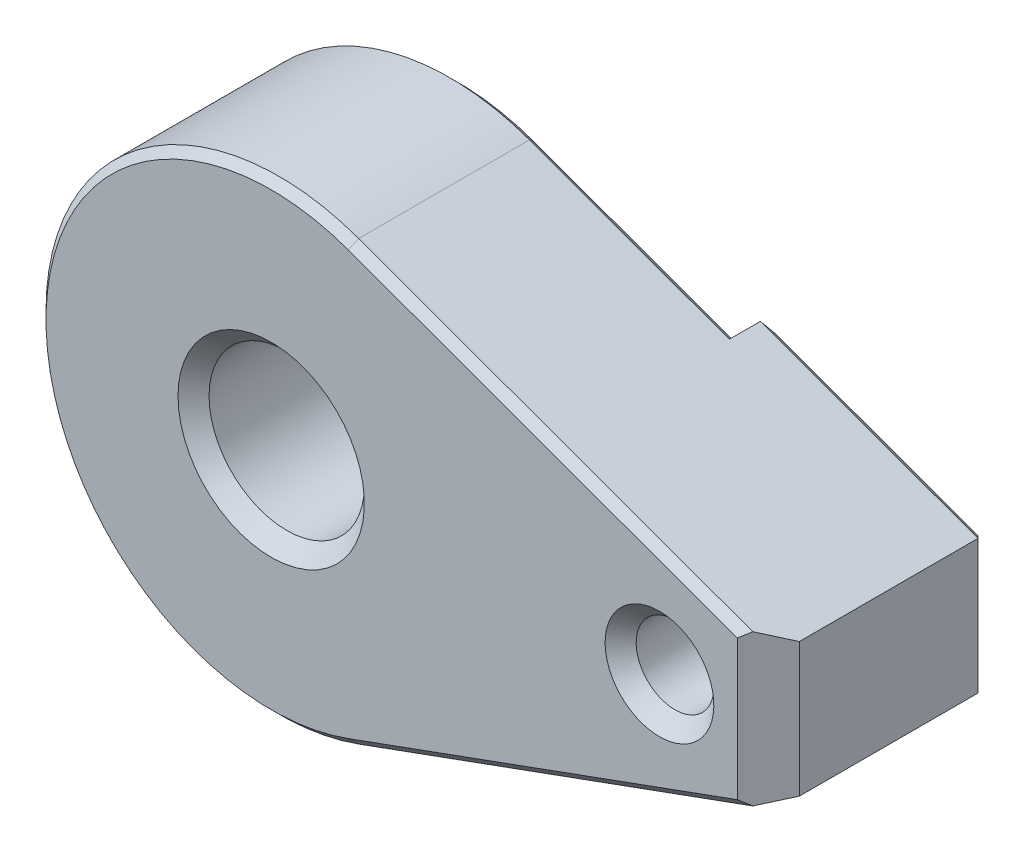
ISO-10303-21;
HEADER;
FILE_DESCRIPTION(('STEP AP214'),'2;1');
FILE_NAME('part.step','',(''),(''),'','','');
FILE_SCHEMA(('AUTOMOTIVE_DESIGN { 1 0 10303 214 1 1 1 1 }'));
ENDSEC;
DATA;
#1=APPLICATION_CONTEXT('core data for automotive mechanical design processes');
#2=APPLICATION_PROTOCOL_DEFINITION('international standard','automotive_design',2000,#1);
#3=PRODUCT_CONTEXT('',#1,'mechanical');
#4=PRODUCT('Part','Part','',(#3));
#5=PRODUCT_RELATED_PRODUCT_CATEGORY('part','',(#4));
#6=PRODUCT_DEFINITION_FORMATION('','',#4);
#7=PRODUCT_DEFINITION_CONTEXT('part definition',#1,'design');
#8=PRODUCT_DEFINITION('design','',#6,#7);
#9=PRODUCT_DEFINITION_SHAPE('','',#8);
#10=(LENGTH_UNIT() NAMED_UNIT(*) SI_UNIT(.MILLI.,.METRE.));
#11=(NAMED_UNIT(*) PLANE_ANGLE_UNIT() SI_UNIT($,.RADIAN.));
#12=(NAMED_UNIT(*) SI_UNIT($,.STERADIAN.) SOLID_ANGLE_UNIT());
#13=UNCERTAINTY_MEASURE_WITH_UNIT(LENGTH_MEASURE(1.E-05),#10,'distance_accuracy_value','');
#14=(GEOMETRIC_REPRESENTATION_CONTEXT(3) GLOBAL_UNCERTAINTY_ASSIGNED_CONTEXT((#13)) GLOBAL_UNIT_ASSIGNED_CONTEXT((#10,
#11,#12)) REPRESENTATION_CONTEXT('',''));
#15=CARTESIAN_POINT('',(0.,0.,0.));
#16=DIRECTION('',(0.,0.,1.));
#17=DIRECTION('',(1.,0.,0.));
#18=AXIS2_PLACEMENT_3D('',#15,#16,#17);
#19=CARTESIAN_POINT('',(18.,15.,0.));
#20=DIRECTION('',(0.,0.,1.));
#21=DIRECTION('',(0.,1.,0.));
#22=AXIS2_PLACEMENT_3D('',#19,#20,#21);
#23=PLANE('',#22);
#24=CARTESIAN_POINT('',(0.,0.,0.));
#25=DIRECTION('',(0.,0.,1.));
#26=DIRECTION('',(0.,1.,0.));
#27=AXIS2_PLACEMENT_3D('',#24,#25,#26);
#28=CIRCLE('',#27,5.5);
#29=CARTESIAN_POINT('',(0.,5.5,0.));
#30=VERTEX_POINT('',#29);
#31=EDGE_CURVE('E268',#30,#30,#28,.T.);
#32=ORIENTED_EDGE('',*,*,#31,.T.);
#33=EDGE_LOOP('',(#32));
#34=FACE_BOUND('',#33,.T.);
#35=DIRECTION('',(0.939692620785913,-0.342020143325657,0.));
#36=VECTOR('',#35,1.);
#37=CARTESIAN_POINT('',(17.8289899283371,8.94135605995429,0.));
#38=LINE('',#37,#36);
#39=CARTESIAN_POINT('',(4.95929207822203,13.6255430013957,0.));
#40=VERTEX_POINT('',#39);
#41=CARTESIAN_POINT('',(17.6,9.02470157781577,0.));
#42=VERTEX_POINT('',#41);
#43=EDGE_CURVE('E207',#40,#42,#38,.T.);
#44=ORIENTED_EDGE('',*,*,#43,.T.);
#45=DIRECTION('',(0.,-1.,0.));
#46=VECTOR('',#45,1.);
#47=CARTESIAN_POINT('',(17.6,-8.87911348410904,0.));
#48=LINE('',#47,#46);
#49=CARTESIAN_POINT('',(17.6,-9.02470157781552,0.));
#50=VERTEX_POINT('',#49);
#51=EDGE_CURVE('E220',#42,#50,#48,.T.);
#52=ORIENTED_EDGE('',*,*,#51,.T.);
#53=DIRECTION('',(-0.939692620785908,-0.342020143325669,0.));
#54=VECTOR('',#53,1.);
#55=CARTESIAN_POINT('',(4.95929207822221,-13.6255430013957,0.));
#56=LINE('',#55,#54);
#57=CARTESIAN_POINT('',(4.95929207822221,-13.6255430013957,0.));
#58=VERTEX_POINT('',#57);
#59=EDGE_CURVE('E212',#50,#58,#56,.T.);
#60=ORIENTED_EDGE('',*,*,#59,.T.);
#61=CARTESIAN_POINT('',(0.,0.,0.));
#62=DIRECTION('',(0.,0.,1.));
#63=DIRECTION('',(0.,1.,0.));
#64=AXIS2_PLACEMENT_3D('',#61,#62,#63);
#65=CIRCLE('',#64,14.5);
#66=EDGE_CURVE('E210',#58,#40,#65,.F.);
#67=ORIENTED_EDGE('',*,*,#66,.T.);
#68=EDGE_LOOP('',(#44,#52,#60,#67));
#69=FACE_BOUND('',#68,.T.);
#70=ADVANCED_FACE('F14',(#34,#69),#23,.F.);
#71=CARTESIAN_POINT('',(18.,15.,0.));
#72=DIRECTION('',(1.,0.,0.));
#73=DIRECTION('',(0.,1.,0.));
#74=AXIS2_PLACEMENT_3D('',#71,#72,#73);
#75=PLANE('',#74);
#76=DIRECTION('',(0.,0.728739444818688,-0.684791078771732));
#77=VECTOR('',#76,1.);
#78=CARTESIAN_POINT('',(18.,3.80215666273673,-11.9164959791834));
#79=LINE('',#78,#77);
#80=CARTESIAN_POINT('',(18.,-9.41120237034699,0.500000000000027));
#81=VERTEX_POINT('',#80);
#82=CARTESIAN_POINT('',(18.,-8.45344237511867,-0.399999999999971));
#83=VERTEX_POINT('',#82);
#84=EDGE_CURVE('E29',#81,#83,#79,.T.);
#85=ORIENTED_EDGE('',*,*,#84,.T.);
#86=DIRECTION('',(0.,-1.,0.));
#87=VECTOR('',#86,1.);
#88=CARTESIAN_POINT('',(18.,8.8791134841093,-0.400000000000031));
#89=LINE('',#88,#87);
#90=CARTESIAN_POINT('',(18.,8.45344237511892,-0.400000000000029));
#91=VERTEX_POINT('',#90);
#92=EDGE_CURVE('E228',#83,#91,#89,.F.);
#93=ORIENTED_EDGE('',*,*,#92,.T.);
#94=DIRECTION('',(0.,0.728739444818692,0.684791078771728));
#95=VECTOR('',#94,1.);
#96=CARTESIAN_POINT('',(18.,12.1296786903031,3.05453213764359));
#97=LINE('',#96,#95);
#98=CARTESIAN_POINT('',(18.,9.41120237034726,0.49999999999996));
#99=VERTEX_POINT('',#98);
#100=EDGE_CURVE('E36',#91,#99,#97,.T.);
#101=ORIENTED_EDGE('',*,*,#100,.T.);
#102=DIRECTION('',(0.,0.,1.));
#103=VECTOR('',#102,1.);
#104=CARTESIAN_POINT('',(18.,9.41120237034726,0.));
#105=LINE('',#104,#103);
#106=CARTESIAN_POINT('',(18.,9.41120237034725,-1.50000000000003));
#107=VERTEX_POINT('',#106);
#108=EDGE_CURVE('E239',#107,#99,#105,.T.);
#109=ORIENTED_EDGE('',*,*,#108,.F.);
#110=DIRECTION('',(0.,-1.,0.));
#111=VECTOR('',#110,1.);
#112=CARTESIAN_POINT('',(18.,15.,-1.50000000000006));
#113=LINE('',#112,#111);
#114=CARTESIAN_POINT('',(18.,-9.411202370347,-1.49999999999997));
#115=VERTEX_POINT('',#114);
#116=EDGE_CURVE('E190',#107,#115,#113,.T.);
#117=ORIENTED_EDGE('',*,*,#116,.T.);
#118=DIRECTION('',(0.,0.,-1.));
#119=VECTOR('',#118,1.);
#120=CARTESIAN_POINT('',(18.,-9.41120237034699,0.));
#121=LINE('',#120,#119);
#122=EDGE_CURVE('E259',#81,#115,#121,.T.);
#123=ORIENTED_EDGE('',*,*,#122,.F.);
#124=EDGE_LOOP('',(#85,#93,#101,#109,#117,#123));
#125=FACE_BOUND('',#124,.T.);
#126=ADVANCED_FACE('F237',(#125),#75,.F.);
#127=CARTESIAN_POINT('',(18.,15.,-2.00000000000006));
#128=DIRECTION('',(0.,0.,1.));
#129=DIRECTION('',(1.,0.,0.));
#130=AXIS2_PLACEMENT_3D('',#127,#128,#129);
#131=PLANE('',#130);
#132=DIRECTION('',(0.,-1.,0.));
#133=VECTOR('',#132,1.);
#134=CARTESIAN_POINT('',(31.51,-4.31197938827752,-2.));
#135=LINE('',#134,#133);
#136=CARTESIAN_POINT('',(31.51,3.96187561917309,-2.));
#137=VERTEX_POINT('',#136);
#138=CARTESIAN_POINT('',(31.51,-3.96187561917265,-2.));
#139=VERTEX_POINT('',#138);
#140=EDGE_CURVE('E184',#137,#139,#135,.T.);
#141=ORIENTED_EDGE('',*,*,#140,.T.);
#142=DIRECTION('',(-0.939692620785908,-0.342020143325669,0.));
#143=VECTOR('',#142,1.);
#144=CARTESIAN_POINT('',(17.8289899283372,-8.94135605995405,-1.99999999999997));
#145=LINE('',#144,#143);
#146=CARTESIAN_POINT('',(18.5,-8.69712836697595,-1.99999999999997));
#147=VERTEX_POINT('',#146);
#148=EDGE_CURVE('E186',#139,#147,#145,.T.);
#149=ORIENTED_EDGE('',*,*,#148,.T.);
#150=DIRECTION('',(0.,1.,0.));
#151=VECTOR('',#150,1.);
#152=CARTESIAN_POINT('',(18.5,15.,-2.00000000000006));
#153=LINE('',#152,#151);
#154=CARTESIAN_POINT('',(18.5,8.69712836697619,-2.00000000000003));
#155=VERTEX_POINT('',#154);
#156=EDGE_CURVE('E182',#147,#155,#153,.T.);
#157=ORIENTED_EDGE('',*,*,#156,.T.);
#158=DIRECTION('',(0.939692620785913,-0.342020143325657,0.));
#159=VECTOR('',#158,1.);
#160=CARTESIAN_POINT('',(31.8389899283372,3.84213307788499,-2.));
#161=LINE('',#160,#159);
#162=EDGE_CURVE('E180',#155,#137,#161,.T.);
#163=ORIENTED_EDGE('',*,*,#162,.T.);
#164=EDGE_LOOP('',(#141,#149,#157,#163));
#165=FACE_BOUND('',#164,.T.);
#166=CARTESIAN_POINT('',(25.,1.6759110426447E-13,-2.));
#167=DIRECTION('',(0.,0.,1.));
#168=DIRECTION('',(1.,0.,0.));
#169=AXIS2_PLACEMENT_3D('',#166,#167,#168);
#170=CIRCLE('',#169,3.5);
#171=CARTESIAN_POINT('',(28.5,1.92031473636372E-13,-2.));
#172=VERTEX_POINT('',#171);
#173=EDGE_CURVE('E164',#172,#172,#170,.T.);
#174=ORIENTED_EDGE('',*,*,#173,.T.);
#175=EDGE_LOOP('',(#174));
#176=FACE_BOUND('',#175,.T.);
#177=ADVANCED_FACE('F320',(#165,#176),#131,.F.);
#178=CARTESIAN_POINT('',(27.9446445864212,-5.79164775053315,-2.));
#179=DIRECTION('',(0.342020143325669,-0.939692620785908,0.));
#180=DIRECTION('',(0.939692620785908,0.342020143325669,0.));
#181=AXIS2_PLACEMENT_3D('',#178,#179,#180);
#182=PLANE('',#181);
#183=DIRECTION('',(0.,0.,1.));
#184=VECTOR('',#183,1.);
#185=CARTESIAN_POINT('',(5.13030214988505,-14.0953893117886,-1.99999999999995));
#186=LINE('',#185,#184);
#187=CARTESIAN_POINT('',(5.13030214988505,-14.0953893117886,0.500000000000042));
#188=VERTEX_POINT('',#187);
#189=CARTESIAN_POINT('',(5.13030214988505,-14.0953893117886,11.5));
#190=VERTEX_POINT('',#189);
#191=EDGE_CURVE('E251',#188,#190,#186,.T.);
#192=ORIENTED_EDGE('',*,*,#191,.F.);
#193=DIRECTION('',(0.939692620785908,0.342020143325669,0.));
#194=VECTOR('',#193,1.);
#195=CARTESIAN_POINT('',(18.,-9.41120237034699,0.500000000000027));
#196=LINE('',#195,#194);
#197=EDGE_CURVE('E194',#188,#81,#196,.T.);
#198=ORIENTED_EDGE('',*,*,#197,.T.);
#199=ORIENTED_EDGE('',*,*,#122,.T.);
#200=DIRECTION('',(0.939692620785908,0.342020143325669,0.));
#201=VECTOR('',#200,1.);
#202=CARTESIAN_POINT('',(32.01,-4.31197938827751,-1.49999999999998));
#203=LINE('',#202,#201);
#204=CARTESIAN_POINT('',(32.01,-4.31197938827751,-1.49999999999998));
#205=VERTEX_POINT('',#204);
#206=EDGE_CURVE('E177',#115,#205,#203,.T.);
#207=ORIENTED_EDGE('',*,*,#206,.T.);
#208=DIRECTION('',(0.,0.,1.));
#209=VECTOR('',#208,1.);
#210=CARTESIAN_POINT('',(32.01,-4.31197938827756,-14.2759866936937));
#211=LINE('',#210,#209);
#212=CARTESIAN_POINT('',(32.01,-4.31197938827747,10.));
#213=VERTEX_POINT('',#212);
#214=EDGE_CURVE('E127',#205,#213,#211,.T.);
#215=ORIENTED_EDGE('',*,*,#214,.T.);
#216=DIRECTION('',(-0.684791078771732,-0.249243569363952,0.684791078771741));
#217=VECTOR('',#216,1.);
#218=CARTESIAN_POINT('',(35.4783134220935,-3.04961653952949,6.53168657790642));
#219=LINE('',#218,#217);
#220=CARTESIAN_POINT('',(30.51,-4.85793473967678,11.5));
#221=VERTEX_POINT('',#220);
#222=EDGE_CURVE('E141',#213,#221,#219,.T.);
#223=ORIENTED_EDGE('',*,*,#222,.T.);
#224=DIRECTION('',(-0.939692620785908,-0.342020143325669,0.));
#225=VECTOR('',#224,1.);
#226=CARTESIAN_POINT('',(5.13030214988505,-14.0953893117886,11.5));
#227=LINE('',#226,#225);
#228=EDGE_CURVE('E157',#221,#190,#227,.T.);
#229=ORIENTED_EDGE('',*,*,#228,.T.);
#230=EDGE_LOOP('',(#192,#198,#199,#207,#215,#223,#229));
#231=FACE_BOUND('',#230,.T.);
#232=ADVANCED_FACE('F289',(#231),#182,.T.);
#233=CARTESIAN_POINT('',(27.9446445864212,5.79164775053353,-2.));
#234=DIRECTION('',(0.342020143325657,0.939692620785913,0.));
#235=DIRECTION('',(-0.939692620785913,0.342020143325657,0.));
#236=AXIS2_PLACEMENT_3D('',#233,#234,#235);
#237=PLANE('',#236);
#238=ORIENTED_EDGE('',*,*,#108,.T.);
#239=DIRECTION('',(-0.939692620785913,0.342020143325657,0.));
#240=VECTOR('',#239,1.);
#241=CARTESIAN_POINT('',(5.13030214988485,14.0953893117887,0.499999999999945));
#242=LINE('',#241,#240);
#243=CARTESIAN_POINT('',(5.13030214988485,14.0953893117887,0.499999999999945));
#244=VERTEX_POINT('',#243);
#245=EDGE_CURVE('E216',#99,#244,#242,.T.);
#246=ORIENTED_EDGE('',*,*,#245,.T.);
#247=DIRECTION('',(0.,0.,1.));
#248=VECTOR('',#247,1.);
#249=CARTESIAN_POINT('',(5.13030214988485,14.0953893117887,-2.00000000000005));
#250=LINE('',#249,#248);
#251=CARTESIAN_POINT('',(5.13030214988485,14.0953893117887,11.5));
#252=VERTEX_POINT('',#251);
#253=EDGE_CURVE('E246',#244,#252,#250,.T.);
#254=ORIENTED_EDGE('',*,*,#253,.T.);
#255=DIRECTION('',(0.939692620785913,-0.342020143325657,0.));
#256=VECTOR('',#255,1.);
#257=CARTESIAN_POINT('',(30.01,5.03991985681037,11.5));
#258=LINE('',#257,#256);
#259=CARTESIAN_POINT('',(30.51,4.85793473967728,11.5));
#260=VERTEX_POINT('',#259);
#261=EDGE_CURVE('E133',#252,#260,#258,.T.);
#262=ORIENTED_EDGE('',*,*,#261,.T.);
#263=DIRECTION('',(0.684791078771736,-0.249243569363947,-0.684791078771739));
#264=VECTOR('',#263,1.);
#265=CARTESIAN_POINT('',(35.4783134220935,3.04961653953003,6.5316865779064));
#266=LINE('',#265,#264);
#267=CARTESIAN_POINT('',(32.01,4.31197938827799,10.));
#268=VERTEX_POINT('',#267);
#269=EDGE_CURVE('E130',#260,#268,#266,.T.);
#270=ORIENTED_EDGE('',*,*,#269,.T.);
#271=DIRECTION('',(0.,0.,1.));
#272=VECTOR('',#271,1.);
#273=CARTESIAN_POINT('',(32.01,4.3119793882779,-14.2759866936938));
#274=LINE('',#273,#272);
#275=CARTESIAN_POINT('',(32.01,4.31197938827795,-1.5));
#276=VERTEX_POINT('',#275);
#277=EDGE_CURVE('E115',#276,#268,#274,.T.);
#278=ORIENTED_EDGE('',*,*,#277,.F.);
#279=DIRECTION('',(-0.939692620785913,0.342020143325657,0.));
#280=VECTOR('',#279,1.);
#281=CARTESIAN_POINT('',(18.,9.41120237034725,-1.50000000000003));
#282=LINE('',#281,#280);
#283=EDGE_CURVE('E192',#276,#107,#282,.T.);
#284=ORIENTED_EDGE('',*,*,#283,.T.);
#285=EDGE_LOOP('',(#238,#246,#254,#262,#270,#278,#284));
#286=FACE_BOUND('',#285,.T.);
#287=ADVANCED_FACE('F131',(#286),#237,.T.);
#288=CARTESIAN_POINT('',(0.,0.,-2.));
#289=DIRECTION('',(0.,0.,1.));
#290=DIRECTION('',(1.,0.,0.));
#291=AXIS2_PLACEMENT_3D('',#288,#289,#290);
#292=CYLINDRICAL_SURFACE('',#291,15.);
#293=ORIENTED_EDGE('',*,*,#253,.F.);
#294=CARTESIAN_POINT('',(0.,0.,0.499999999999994));
#295=DIRECTION('',(0.,0.,1.));
#296=DIRECTION('',(1.,0.,0.));
#297=AXIS2_PLACEMENT_3D('',#294,#295,#296);
#298=CIRCLE('',#297,15.);
#299=EDGE_CURVE('E214',#244,#188,#298,.T.);
#300=ORIENTED_EDGE('',*,*,#299,.T.);
#301=ORIENTED_EDGE('',*,*,#191,.T.);
#302=CARTESIAN_POINT('',(0.,0.,11.5));
#303=DIRECTION('',(0.,0.,-1.));
#304=DIRECTION('',(-1.,0.,0.));
#305=AXIS2_PLACEMENT_3D('',#302,#303,#304);
#306=CIRCLE('',#305,15.);
#307=EDGE_CURVE('E160',#190,#252,#306,.T.);
#308=ORIENTED_EDGE('',*,*,#307,.T.);
#309=EDGE_LOOP('',(#293,#300,#301,#308));
#310=FACE_BOUND('',#309,.T.);
#311=ADVANCED_FACE('F248',(#310),#292,.T.);
#312=CARTESIAN_POINT('',(-15.,15.,12.));
#313=DIRECTION('',(0.,0.,-1.));
#314=DIRECTION('',(-1.,0.,0.));
#315=AXIS2_PLACEMENT_3D('',#312,#313,#314);
#316=PLANE('',#315);
#317=CARTESIAN_POINT('',(0.,0.,12.));
#318=DIRECTION('',(0.,0.,-1.));
#319=DIRECTION('',(-1.,0.,0.));
#320=AXIS2_PLACEMENT_3D('',#317,#318,#319);
#321=CIRCLE('',#320,6.);
#322=CARTESIAN_POINT('',(-6.,0.,12.));
#323=VERTEX_POINT('',#322);
#324=EDGE_CURVE('E265',#323,#323,#321,.T.);
#325=ORIENTED_EDGE('',*,*,#324,.T.);
#326=EDGE_LOOP('',(#325));
#327=FACE_BOUND('',#326,.T.);
#328=CARTESIAN_POINT('',(25.,2.16471843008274E-13,12.));
#329=DIRECTION('',(0.,0.,1.));
#330=DIRECTION('',(0.,1.,0.));
#331=AXIS2_PLACEMENT_3D('',#328,#329,#330);
#332=CIRCLE('',#331,3.5);
#333=CARTESIAN_POINT('',(25.,3.50000000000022,12.));
#334=VERTEX_POINT('',#333);
#335=EDGE_CURVE('E126',#334,#334,#332,.T.);
#336=ORIENTED_EDGE('',*,*,#335,.F.);
#337=EDGE_LOOP('',(#336));
#338=FACE_BOUND('',#337,.T.);
#339=CARTESIAN_POINT('',(0.,0.,12.));
#340=DIRECTION('',(0.,0.,-1.));
#341=DIRECTION('',(-1.,0.,0.));
#342=AXIS2_PLACEMENT_3D('',#339,#340,#341);
#343=CIRCLE('',#342,14.5);
#344=CARTESIAN_POINT('',(4.95929207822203,13.6255430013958,12.));
#345=VERTEX_POINT('',#344);
#346=CARTESIAN_POINT('',(4.95929207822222,-13.6255430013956,12.));
#347=VERTEX_POINT('',#346);
#348=EDGE_CURVE('E148',#345,#347,#343,.F.);
#349=ORIENTED_EDGE('',*,*,#348,.T.);
#350=DIRECTION('',(0.939692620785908,0.342020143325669,0.));
#351=VECTOR('',#350,1.);
#352=CARTESIAN_POINT('',(29.8389899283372,-4.57007354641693,12.));
#353=LINE('',#352,#351);
#354=CARTESIAN_POINT('',(30.01,-4.50783097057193,12.));
#355=VERTEX_POINT('',#354);
#356=EDGE_CURVE('E150',#347,#355,#353,.T.);
#357=ORIENTED_EDGE('',*,*,#356,.T.);
#358=DIRECTION('',(0.,1.,0.));
#359=VECTOR('',#358,1.);
#360=CARTESIAN_POINT('',(30.01,4.31197938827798,12.));
#361=LINE('',#360,#359);
#362=CARTESIAN_POINT('',(30.01,4.50783097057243,12.));
#363=VERTEX_POINT('',#362);
#364=EDGE_CURVE('E136',#355,#363,#361,.T.);
#365=ORIENTED_EDGE('',*,*,#364,.T.);
#366=DIRECTION('',(-0.939692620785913,0.342020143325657,0.));
#367=VECTOR('',#366,1.);
#368=CARTESIAN_POINT('',(4.95929207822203,13.6255430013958,12.));
#369=LINE('',#368,#367);
#370=EDGE_CURVE('E143',#363,#345,#369,.T.);
#371=ORIENTED_EDGE('',*,*,#370,.T.);
#372=EDGE_LOOP('',(#349,#357,#365,#371));
#373=FACE_BOUND('',#372,.T.);
#374=ADVANCED_FACE('F276',(#327,#338,#373),#316,.F.);
#375=CARTESIAN_POINT('',(25.,2.16471843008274E-13,12.));
#376=DIRECTION('',(0.,0.,1.));
#377=DIRECTION('',(0.,1.,0.));
#378=AXIS2_PLACEMENT_3D('',#375,#376,#377);
#379=CYLINDRICAL_SURFACE('',#378,2.5);
#380=CARTESIAN_POINT('',(25.,1.71082585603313E-13,-1.));
#381=DIRECTION('',(0.,0.,1.));
#382=DIRECTION('',(0.,1.,0.));
#383=AXIS2_PLACEMENT_3D('',#380,#381,#382);
#384=CIRCLE('',#383,2.5);
#385=CARTESIAN_POINT('',(25.,2.50000000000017,-1.00000000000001));
#386=VERTEX_POINT('',#385);
#387=EDGE_CURVE('E174',#386,#386,#384,.F.);
#388=ORIENTED_EDGE('',*,*,#387,.T.);
#389=EDGE_LOOP('',(#388));
#390=FACE_BOUND('',#389,.T.);
#391=CARTESIAN_POINT('',(25.,2.12980361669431E-13,11.));
#392=DIRECTION('',(0.,0.,1.));
#393=DIRECTION('',(0.,1.,0.));
#394=AXIS2_PLACEMENT_3D('',#391,#392,#393);
#395=CIRCLE('',#394,2.5);
#396=CARTESIAN_POINT('',(25.,2.50000000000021,11.));
#397=VERTEX_POINT('',#396);
#398=EDGE_CURVE('E252',#397,#397,#395,.T.);
#399=ORIENTED_EDGE('',*,*,#398,.T.);
#400=EDGE_LOOP('',(#399));
#401=FACE_BOUND('',#400,.T.);
#402=ADVANCED_FACE('F299',(#390,#401),#379,.F.);
#403=CARTESIAN_POINT('',(25.,2.16471843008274E-13,12.));
#404=DIRECTION('',(0.,0.,1.));
#405=DIRECTION('',(0.,1.,0.));
#406=AXIS2_PLACEMENT_3D('',#403,#404,#405);
#407=CONICAL_SURFACE('',#406,3.5,0.785398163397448);
#408=ORIENTED_EDGE('',*,*,#398,.F.);
#409=EDGE_LOOP('',(#408));
#410=FACE_BOUND('',#409,.T.);
#411=ORIENTED_EDGE('',*,*,#335,.T.);
#412=EDGE_LOOP('',(#411));
#413=FACE_BOUND('',#412,.T.);
#414=ADVANCED_FACE('F296',(#410,#413),#407,.F.);
#415=CARTESIAN_POINT('',(32.01,-4.31197938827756,-14.2759866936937));
#416=DIRECTION('',(1.,0.,0.));
#417=DIRECTION('',(0.,0.,-1.));
#418=AXIS2_PLACEMENT_3D('',#415,#416,#417);
#419=PLANE('',#418);
#420=ORIENTED_EDGE('',*,*,#214,.F.);
#421=DIRECTION('',(0.,1.,0.));
#422=VECTOR('',#421,1.);
#423=CARTESIAN_POINT('',(32.01,4.31197938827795,-1.5));
#424=LINE('',#423,#422);
#425=EDGE_CURVE('E123',#205,#276,#424,.T.);
#426=ORIENTED_EDGE('',*,*,#425,.T.);
#427=ORIENTED_EDGE('',*,*,#277,.T.);
#428=DIRECTION('',(0.,-1.,0.));
#429=VECTOR('',#428,1.);
#430=CARTESIAN_POINT('',(32.01,-4.31197938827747,10.));
#431=LINE('',#430,#429);
#432=EDGE_CURVE('E120',#268,#213,#431,.T.);
#433=ORIENTED_EDGE('',*,*,#432,.T.);
#434=EDGE_LOOP('',(#420,#426,#427,#433));
#435=FACE_BOUND('',#434,.T.);
#436=ADVANCED_FACE('F118',(#435),#419,.T.);
#437=CARTESIAN_POINT('',(0.,0.,-2.));
#438=DIRECTION('',(0.,0.,1.));
#439=DIRECTION('',(1.,0.,0.));
#440=AXIS2_PLACEMENT_3D('',#437,#438,#439);
#441=CYLINDRICAL_SURFACE('',#440,5.);
#442=CARTESIAN_POINT('',(0.,0.,0.5));
#443=DIRECTION('',(0.,0.,1.));
#444=DIRECTION('',(1.,0.,0.));
#445=AXIS2_PLACEMENT_3D('',#442,#443,#444);
#446=CIRCLE('',#445,5.);
#447=CARTESIAN_POINT('',(5.,0.,0.499999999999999));
#448=VERTEX_POINT('',#447);
#449=EDGE_CURVE('E271',#448,#448,#446,.F.);
#450=ORIENTED_EDGE('',*,*,#449,.T.);
#451=EDGE_LOOP('',(#450));
#452=FACE_BOUND('',#451,.T.);
#453=CARTESIAN_POINT('',(0.,0.,11.));
#454=DIRECTION('',(0.,0.,-1.));
#455=DIRECTION('',(-1.,0.,0.));
#456=AXIS2_PLACEMENT_3D('',#453,#454,#455);
#457=CIRCLE('',#456,5.);
#458=CARTESIAN_POINT('',(-5.,0.,11.));
#459=VERTEX_POINT('',#458);
#460=EDGE_CURVE('E262',#459,#459,#457,.F.);
#461=ORIENTED_EDGE('',*,*,#460,.T.);
#462=EDGE_LOOP('',(#461));
#463=FACE_BOUND('',#462,.T.);
#464=ADVANCED_FACE('F442',(#452,#463),#441,.F.);
#465=CARTESIAN_POINT('',(0.,0.,11.));
#466=DIRECTION('',(0.,0.,1.));
#467=DIRECTION('',(1.,0.,0.));
#468=AXIS2_PLACEMENT_3D('',#465,#466,#467);
#469=CONICAL_SURFACE('',#468,5.,0.785398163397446);
#470=ORIENTED_EDGE('',*,*,#324,.F.);
#471=EDGE_LOOP('',(#470));
#472=FACE_BOUND('',#471,.T.);
#473=ORIENTED_EDGE('',*,*,#460,.F.);
#474=EDGE_LOOP('',(#473));
#475=FACE_BOUND('',#474,.T.);
#476=ADVANCED_FACE('F432',(#472,#475),#469,.F.);
#477=CARTESIAN_POINT('',(0.,0.,0.));
#478=DIRECTION('',(0.,0.,-1.));
#479=DIRECTION('',(-1.,0.,0.));
#480=AXIS2_PLACEMENT_3D('',#477,#478,#479);
#481=CONICAL_SURFACE('',#480,5.5,0.785398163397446);
#482=ORIENTED_EDGE('',*,*,#449,.F.);
#483=EDGE_LOOP('',(#482));
#484=FACE_BOUND('',#483,.T.);
#485=ORIENTED_EDGE('',*,*,#31,.F.);
#486=EDGE_LOOP('',(#485));
#487=FACE_BOUND('',#486,.T.);
#488=ADVANCED_FACE('F423',(#484,#487),#481,.F.);
#489=CARTESIAN_POINT('',(30.01,15.0000000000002,12.));
#490=DIRECTION('',(0.707106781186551,0.,0.707106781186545));
#491=DIRECTION('',(0.,-1.,0.));
#492=AXIS2_PLACEMENT_3D('',#489,#490,#491);
#493=PLANE('',#492);
#494=ORIENTED_EDGE('',*,*,#364,.F.);
#495=DIRECTION('',(0.633687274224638,-0.443712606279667,-0.633687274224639));
#496=VECTOR('',#495,1.);
#497=CARTESIAN_POINT('',(24.5248850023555,-0.667112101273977,17.4851149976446));
#498=LINE('',#497,#496);
#499=EDGE_CURVE('E155',#355,#221,#498,.T.);
#500=ORIENTED_EDGE('',*,*,#499,.T.);
#501=ORIENTED_EDGE('',*,*,#222,.F.);
#502=ORIENTED_EDGE('',*,*,#432,.F.);
#503=ORIENTED_EDGE('',*,*,#269,.F.);
#504=DIRECTION('',(-0.633687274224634,-0.443712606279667,0.633687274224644));
#505=VECTOR('',#504,1.);
#506=CARTESIAN_POINT('',(32.9601359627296,6.57353841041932,9.04986403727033));
#507=LINE('',#506,#505);
#508=EDGE_CURVE('E153',#260,#363,#507,.T.);
#509=ORIENTED_EDGE('',*,*,#508,.T.);
#510=EDGE_LOOP('',(#494,#500,#501,#502,#503,#509));
#511=FACE_BOUND('',#510,.T.);
#512=ADVANCED_FACE('F139',(#511),#493,.T.);
#513=CARTESIAN_POINT('',(-13.1069483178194,20.2011167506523,12.));
#514=DIRECTION('',(0.241844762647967,0.664463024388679,0.707106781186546));
#515=DIRECTION('',(0.939692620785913,-0.342020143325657,0.));
#516=AXIS2_PLACEMENT_3D('',#513,#514,#515);
#517=PLANE('',#516);
#518=ORIENTED_EDGE('',*,*,#508,.F.);
#519=ORIENTED_EDGE('',*,*,#261,.F.);
#520=DIRECTION('',(0.241844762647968,0.664463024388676,-0.707106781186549));
#521=VECTOR('',#520,1.);
#522=CARTESIAN_POINT('',(4.95929207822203,13.6255430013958,12.));
#523=LINE('',#522,#521);
#524=EDGE_CURVE('E168',#345,#252,#523,.T.);
#525=ORIENTED_EDGE('',*,*,#524,.F.);
#526=ORIENTED_EDGE('',*,*,#370,.F.);
#527=EDGE_LOOP('',(#518,#519,#525,#526));
#528=FACE_BOUND('',#527,.T.);
#529=ADVANCED_FACE('F280',(#528),#517,.T.);
#530=CARTESIAN_POINT('',(0.,0.,12.));
#531=DIRECTION('',(0.,0.,-1.));
#532=DIRECTION('',(-1.,0.,0.));
#533=AXIS2_PLACEMENT_3D('',#530,#531,#532);
#534=CONICAL_SURFACE('',#533,14.5,0.78539816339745);
#535=ORIENTED_EDGE('',*,*,#524,.T.);
#536=ORIENTED_EDGE('',*,*,#307,.F.);
#537=DIRECTION('',(0.241844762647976,-0.664463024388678,-0.707106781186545));
#538=VECTOR('',#537,1.);
#539=CARTESIAN_POINT('',(4.95929207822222,-13.6255430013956,12.));
#540=LINE('',#539,#538);
#541=EDGE_CURVE('E165',#347,#190,#540,.T.);
#542=ORIENTED_EDGE('',*,*,#541,.F.);
#543=ORIENTED_EDGE('',*,*,#348,.F.);
#544=EDGE_LOOP('',(#535,#536,#542,#543));
#545=FACE_BOUND('',#544,.T.);
#546=ADVANCED_FACE('F284',(#545),#534,.T.);
#547=CARTESIAN_POINT('',(-3.46513417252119,-16.6917833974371,12.));
#548=DIRECTION('',(0.241844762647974,-0.664463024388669,0.707106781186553));
#549=DIRECTION('',(-0.939692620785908,-0.342020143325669,0.));
#550=AXIS2_PLACEMENT_3D('',#547,#548,#549);
#551=PLANE('',#550);
#552=ORIENTED_EDGE('',*,*,#541,.T.);
#553=ORIENTED_EDGE('',*,*,#228,.F.);
#554=ORIENTED_EDGE('',*,*,#499,.F.);
#555=ORIENTED_EDGE('',*,*,#356,.F.);
#556=EDGE_LOOP('',(#552,#553,#554,#555));
#557=FACE_BOUND('',#556,.T.);
#558=ADVANCED_FACE('F287',(#557),#551,.T.);
#559=CARTESIAN_POINT('',(25.,1.6759110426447E-13,-2.));
#560=DIRECTION('',(0.,0.,-1.));
#561=DIRECTION('',(0.,-1.,0.));
#562=AXIS2_PLACEMENT_3D('',#559,#560,#561);
#563=CONICAL_SURFACE('',#562,3.5,0.785398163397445);
#564=ORIENTED_EDGE('',*,*,#387,.F.);
#565=EDGE_LOOP('',(#564));
#566=FACE_BOUND('',#565,.T.);
#567=ORIENTED_EDGE('',*,*,#173,.F.);
#568=EDGE_LOOP('',(#567));
#569=FACE_BOUND('',#568,.T.);
#570=ADVANCED_FACE('F336',(#566,#569),#563,.F.);
#571=CARTESIAN_POINT('',(27.9446445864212,5.79164775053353,-1.5));
#572=DIRECTION('',(0.241844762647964,0.664463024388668,-0.707106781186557));
#573=DIRECTION('',(0.939692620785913,-0.342020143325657,0.));
#574=AXIS2_PLACEMENT_3D('',#571,#572,#573);
#575=PLANE('',#574);
#576=DIRECTION('',(-0.63368727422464,-0.443712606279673,-0.633687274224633));
#577=VECTOR('',#576,1.);
#578=CARTESIAN_POINT('',(30.7935634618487,3.4602213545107,-2.71643653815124));
#579=LINE('',#578,#577);
#580=EDGE_CURVE('E200',#137,#276,#579,.F.);
#581=ORIENTED_EDGE('',*,*,#580,.F.);
#582=ORIENTED_EDGE('',*,*,#162,.F.);
#583=DIRECTION('',(0.49754281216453,-0.71056477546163,-0.497542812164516));
#584=VECTOR('',#583,1.);
#585=CARTESIAN_POINT('',(21.7414296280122,4.06788710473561,-5.24142962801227));
#586=LINE('',#585,#584);
#587=EDGE_CURVE('E169',#107,#155,#586,.T.);
#588=ORIENTED_EDGE('',*,*,#587,.F.);
#589=ORIENTED_EDGE('',*,*,#283,.F.);
#590=EDGE_LOOP('',(#581,#582,#588,#589));
#591=FACE_BOUND('',#590,.T.);
#592=ADVANCED_FACE('F338',(#591),#575,.T.);
#593=CARTESIAN_POINT('',(18.,15.,-1.50000000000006));
#594=DIRECTION('',(0.707106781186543,0.,0.707106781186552));
#595=DIRECTION('',(0.,-1.,0.));
#596=AXIS2_PLACEMENT_3D('',#593,#594,#595);
#597=PLANE('',#596);
#598=ORIENTED_EDGE('',*,*,#587,.T.);
#599=ORIENTED_EDGE('',*,*,#156,.F.);
#600=DIRECTION('',(0.49754281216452,0.710564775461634,-0.497542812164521));
#601=VECTOR('',#600,1.);
#602=CARTESIAN_POINT('',(26.6302485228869,2.91406985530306,-10.1302485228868));
#603=LINE('',#602,#601);
#604=EDGE_CURVE('E197',#115,#147,#603,.T.);
#605=ORIENTED_EDGE('',*,*,#604,.F.);
#606=ORIENTED_EDGE('',*,*,#116,.F.);
#607=EDGE_LOOP('',(#598,#599,#605,#606));
#608=FACE_BOUND('',#607,.T.);
#609=ADVANCED_FACE('F346',(#608),#597,.F.);
#610=CARTESIAN_POINT('',(31.51,15.,-2.00000000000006));
#611=DIRECTION('',(0.707106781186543,0.,-0.707106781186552));
#612=DIRECTION('',(0.,1.,0.));
#613=AXIS2_PLACEMENT_3D('',#610,#611,#612);
#614=PLANE('',#613);
#615=ORIENTED_EDGE('',*,*,#580,.T.);
#616=ORIENTED_EDGE('',*,*,#425,.F.);
#617=DIRECTION('',(-0.633687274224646,0.443712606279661,-0.633687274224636));
#618=VECTOR('',#617,1.);
#619=CARTESIAN_POINT('',(26.1783940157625,-0.228644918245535,-7.33160598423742));
#620=LINE('',#619,#618);
#621=EDGE_CURVE('E195',#139,#205,#620,.F.);
#622=ORIENTED_EDGE('',*,*,#621,.F.);
#623=ORIENTED_EDGE('',*,*,#140,.F.);
#624=EDGE_LOOP('',(#615,#616,#622,#623));
#625=FACE_BOUND('',#624,.T.);
#626=ADVANCED_FACE('F357',(#625),#614,.T.);
#627=CARTESIAN_POINT('',(27.9446445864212,-5.79164775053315,-1.49999999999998));
#628=DIRECTION('',(0.241844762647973,-0.66446302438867,-0.707106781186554));
#629=DIRECTION('',(-0.939692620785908,-0.342020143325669,0.));
#630=AXIS2_PLACEMENT_3D('',#627,#628,#629);
#631=PLANE('',#630);
#632=ORIENTED_EDGE('',*,*,#604,.T.);
#633=ORIENTED_EDGE('',*,*,#148,.F.);
#634=ORIENTED_EDGE('',*,*,#621,.T.);
#635=ORIENTED_EDGE('',*,*,#206,.F.);
#636=EDGE_LOOP('',(#632,#633,#634,#635));
#637=FACE_BOUND('',#636,.T.);
#638=ADVANCED_FACE('F354',(#637),#631,.T.);
#639=CARTESIAN_POINT('',(27.9446445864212,5.79164775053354,0.499999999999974));
#640=DIRECTION('',(0.241844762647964,0.664463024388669,-0.707106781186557));
#641=DIRECTION('',(0.939692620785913,-0.342020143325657,0.));
#642=AXIS2_PLACEMENT_3D('',#639,#640,#641);
#643=PLANE('',#642);
#644=ORIENTED_EDGE('',*,*,#100,.F.);
#645=CARTESIAN_POINT('',(17.6,8.5990304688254,-0.40000000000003));
#646=DIRECTION('',(0.241844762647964,0.664463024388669,-0.707106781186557));
#647=DIRECTION('',(-0.215030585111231,0.74732114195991,0.628707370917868));
#648=AXIS2_PLACEMENT_3D('',#645,#646,#647);
#649=ELLIPSE('',#648,0.601989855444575,0.4);
#650=EDGE_CURVE('E9',#91,#42,#649,.F.);
#651=ORIENTED_EDGE('',*,*,#650,.T.);
#652=ORIENTED_EDGE('',*,*,#43,.F.);
#653=DIRECTION('',(-0.241844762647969,-0.664463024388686,-0.70710678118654));
#654=VECTOR('',#653,1.);
#655=CARTESIAN_POINT('',(5.13030214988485,14.0953893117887,0.499999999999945));
#656=LINE('',#655,#654);
#657=EDGE_CURVE('E198',#244,#40,#656,.T.);
#658=ORIENTED_EDGE('',*,*,#657,.F.);
#659=ORIENTED_EDGE('',*,*,#245,.F.);
#660=EDGE_LOOP('',(#644,#651,#652,#658,#659));
#661=FACE_BOUND('',#660,.T.);
#662=ADVANCED_FACE('F242',(#661),#643,.T.);
#663=CARTESIAN_POINT('',(0.,0.,0.499999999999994));
#664=DIRECTION('',(0.,0.,1.));
#665=DIRECTION('',(1.,0.,0.));
#666=AXIS2_PLACEMENT_3D('',#663,#664,#665);
#667=CONICAL_SURFACE('',#666,15.,0.785398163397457);
#668=ORIENTED_EDGE('',*,*,#657,.T.);
#669=ORIENTED_EDGE('',*,*,#66,.F.);
#670=DIRECTION('',(-0.241844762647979,0.664463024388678,-0.707106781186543));
#671=VECTOR('',#670,1.);
#672=CARTESIAN_POINT('',(5.13030214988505,-14.0953893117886,0.500000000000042));
#673=LINE('',#672,#671);
#674=EDGE_CURVE('E221',#188,#58,#673,.T.);
#675=ORIENTED_EDGE('',*,*,#674,.F.);
#676=ORIENTED_EDGE('',*,*,#299,.F.);
#677=EDGE_LOOP('',(#668,#669,#675,#676));
#678=FACE_BOUND('',#677,.T.);
#679=ADVANCED_FACE('F367',(#678),#667,.T.);
#680=CARTESIAN_POINT('',(27.9446445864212,-5.79164775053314,0.500000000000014));
#681=DIRECTION('',(0.241844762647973,-0.66446302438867,-0.707106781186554));
#682=DIRECTION('',(-0.939692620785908,-0.342020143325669,0.));
#683=AXIS2_PLACEMENT_3D('',#680,#681,#682);
#684=PLANE('',#683);
#685=ORIENTED_EDGE('',*,*,#674,.T.);
#686=ORIENTED_EDGE('',*,*,#59,.F.);
#687=CARTESIAN_POINT('',(17.6,-8.59903046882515,-0.39999999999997));
#688=DIRECTION('',(0.241844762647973,-0.66446302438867,-0.707106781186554));
#689=DIRECTION('',(0.215030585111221,0.747321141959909,-0.628707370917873));
#690=AXIS2_PLACEMENT_3D('',#687,#688,#689);
#691=ELLIPSE('',#690,0.601989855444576,0.4);
#692=EDGE_CURVE('E22',#50,#83,#691,.F.);
#693=ORIENTED_EDGE('',*,*,#692,.T.);
#694=ORIENTED_EDGE('',*,*,#84,.F.);
#695=ORIENTED_EDGE('',*,*,#197,.F.);
#696=EDGE_LOOP('',(#685,#686,#693,#694,#695));
#697=FACE_BOUND('',#696,.T.);
#698=ADVANCED_FACE('F232',(#697),#684,.T.);
#699=CARTESIAN_POINT('',(17.6,15.,-0.400000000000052));
#700=DIRECTION('',(0.,1.,0.));
#701=DIRECTION('',(-1.,0.,0.));
#702=AXIS2_PLACEMENT_3D('',#699,#700,#701);
#703=CYLINDRICAL_SURFACE('',#702,0.4);
#704=ORIENTED_EDGE('',*,*,#650,.F.);
#705=ORIENTED_EDGE('',*,*,#92,.F.);
#706=ORIENTED_EDGE('',*,*,#692,.F.);
#707=ORIENTED_EDGE('',*,*,#51,.F.);
#708=EDGE_LOOP('',(#704,#705,#706,#707));
#709=FACE_BOUND('',#708,.T.);
#710=ADVANCED_FACE('F16',(#709),#703,.F.);
#711=CLOSED_SHELL('',(#70,#126,#177,#232,#287,#311,#374,#402,#414,#436,#464,#476,#488,#512,#529,
#546,#558,#570,#592,#609,#626,#638,#662,#679,#698,#710));
#712=MANIFOLD_SOLID_BREP('B1',#711);
#713=ADVANCED_BREP_SHAPE_REPRESENTATION('',(#18,#712),#14);
#714=SHAPE_DEFINITION_REPRESENTATION(#9,#713);
ENDSEC;
END-ISO-10303-21;
